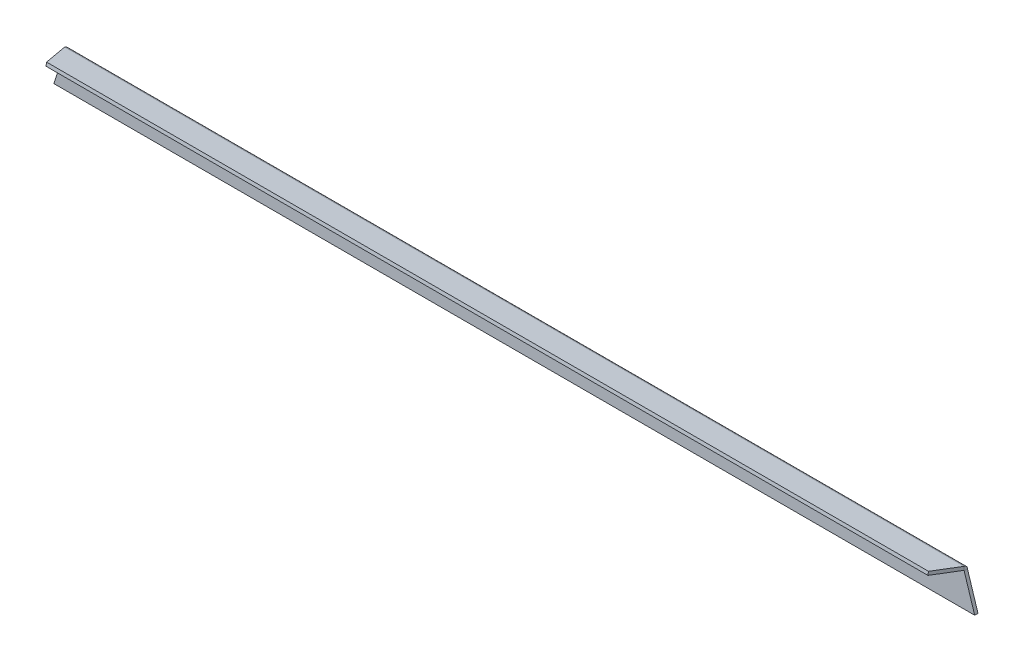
ISO-10303-21;
HEADER;
FILE_DESCRIPTION(('STEP AP214'),'2;1');
FILE_NAME('part.step','',(''),(''),'','','');
FILE_SCHEMA(('AUTOMOTIVE_DESIGN { 1 0 10303 214 1 1 1 1 }'));
ENDSEC;
DATA;
#1=APPLICATION_CONTEXT('core data for automotive mechanical design processes');
#2=APPLICATION_PROTOCOL_DEFINITION('international standard','automotive_design',2000,#1);
#3=PRODUCT_CONTEXT('',#1,'mechanical');
#4=PRODUCT('Part','Part','',(#3));
#5=PRODUCT_RELATED_PRODUCT_CATEGORY('part','',(#4));
#6=PRODUCT_DEFINITION_FORMATION('','',#4);
#7=PRODUCT_DEFINITION_CONTEXT('part definition',#1,'design');
#8=PRODUCT_DEFINITION('design','',#6,#7);
#9=PRODUCT_DEFINITION_SHAPE('','',#8);
#10=(LENGTH_UNIT() NAMED_UNIT(*) SI_UNIT(.MILLI.,.METRE.));
#11=(NAMED_UNIT(*) PLANE_ANGLE_UNIT() SI_UNIT($,.RADIAN.));
#12=(NAMED_UNIT(*) SI_UNIT($,.STERADIAN.) SOLID_ANGLE_UNIT());
#13=UNCERTAINTY_MEASURE_WITH_UNIT(LENGTH_MEASURE(1.E-05),#10,'distance_accuracy_value','');
#14=(GEOMETRIC_REPRESENTATION_CONTEXT(3) GLOBAL_UNCERTAINTY_ASSIGNED_CONTEXT((#13)) GLOBAL_UNIT_ASSIGNED_CONTEXT((#10,
#11,#12)) REPRESENTATION_CONTEXT('',''));
#15=CARTESIAN_POINT('',(0.,0.,0.));
#16=DIRECTION('',(0.,0.,1.));
#17=DIRECTION('',(1.,0.,0.));
#18=AXIS2_PLACEMENT_3D('',#15,#16,#17);
#19=CARTESIAN_POINT('',(-830.,-60.0000000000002,6.));
#20=DIRECTION('',(0.953342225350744,-0.3018917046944,0.));
#21=DIRECTION('',(0.3018917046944,0.953342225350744,0.));
#22=AXIS2_PLACEMENT_3D('',#19,#20,#21);
#23=PLANE('',#22);
#24=DIRECTION('',(-0.3018917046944,-0.953342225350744,0.));
#25=VECTOR('',#24,1.);
#26=CARTESIAN_POINT('',(-830.,-60.0000000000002,0.));
#27=LINE('',#26,#25);
#28=CARTESIAN_POINT('',(-811.,-3.24201747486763E-13,0.));
#29=VERTEX_POINT('',#28);
#30=CARTESIAN_POINT('',(-830.,-60.0000000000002,0.));
#31=VERTEX_POINT('',#30);
#32=EDGE_CURVE('E194',#29,#31,#27,.T.);
#33=ORIENTED_EDGE('',*,*,#32,.T.);
#34=DIRECTION('',(0.,0.,-1.));
#35=VECTOR('',#34,1.);
#36=CARTESIAN_POINT('',(-830.,-60.0000000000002,6.));
#37=LINE('',#36,#35);
#38=CARTESIAN_POINT('',(-830.,-60.0000000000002,6.));
#39=VERTEX_POINT('',#38);
#40=EDGE_CURVE('E13',#39,#31,#37,.T.);
#41=ORIENTED_EDGE('',*,*,#40,.F.);
#42=DIRECTION('',(-0.3018917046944,-0.953342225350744,0.));
#43=VECTOR('',#42,1.);
#44=CARTESIAN_POINT('',(-830.,-60.0000000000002,6.));
#45=LINE('',#44,#43);
#46=CARTESIAN_POINT('',(-811.,0.,6.));
#47=VERTEX_POINT('',#46);
#48=EDGE_CURVE('E209',#47,#39,#45,.T.);
#49=ORIENTED_EDGE('',*,*,#48,.F.);
#50=DIRECTION('',(0.,0.,-1.));
#51=VECTOR('',#50,1.);
#52=CARTESIAN_POINT('',(-811.,0.,6.));
#53=LINE('',#52,#51);
#54=EDGE_CURVE('E215',#47,#29,#53,.T.);
#55=ORIENTED_EDGE('',*,*,#54,.T.);
#56=EDGE_LOOP('',(#33,#41,#49,#55));
#57=FACE_BOUND('',#56,.T.);
#58=ADVANCED_FACE('F51',(#57),#23,.F.);
#59=CARTESIAN_POINT('',(830.,-60.,6.));
#60=DIRECTION('',(0.,1.,0.));
#61=DIRECTION('',(-1.,0.,0.));
#62=AXIS2_PLACEMENT_3D('',#59,#60,#61);
#63=PLANE('',#62);
#64=DIRECTION('',(1.,0.,0.));
#65=VECTOR('',#64,1.);
#66=CARTESIAN_POINT('',(830.,-60.,0.));
#67=LINE('',#66,#65);
#68=CARTESIAN_POINT('',(830.,-60.,0.));
#69=VERTEX_POINT('',#68);
#70=EDGE_CURVE('E202',#31,#69,#67,.T.);
#71=ORIENTED_EDGE('',*,*,#70,.T.);
#72=DIRECTION('',(0.,0.,-1.));
#73=VECTOR('',#72,1.);
#74=CARTESIAN_POINT('',(830.,-60.,6.));
#75=LINE('',#74,#73);
#76=CARTESIAN_POINT('',(830.,-60.,6.));
#77=VERTEX_POINT('',#76);
#78=EDGE_CURVE('E58',#77,#69,#75,.T.);
#79=ORIENTED_EDGE('',*,*,#78,.F.);
#80=DIRECTION('',(1.,0.,0.));
#81=VECTOR('',#80,1.);
#82=CARTESIAN_POINT('',(830.,-60.,6.));
#83=LINE('',#82,#81);
#84=EDGE_CURVE('E211',#39,#77,#83,.T.);
#85=ORIENTED_EDGE('',*,*,#84,.F.);
#86=ORIENTED_EDGE('',*,*,#40,.T.);
#87=EDGE_LOOP('',(#71,#79,#85,#86));
#88=FACE_BOUND('',#87,.T.);
#89=ADVANCED_FACE('F249',(#88),#63,.F.);
#90=CARTESIAN_POINT('',(811.,1.9863115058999E-13,6.));
#91=DIRECTION('',(-0.953342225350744,-0.3018917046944,0.));
#92=DIRECTION('',(0.3018917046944,-0.953342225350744,0.));
#93=AXIS2_PLACEMENT_3D('',#90,#91,#92);
#94=PLANE('',#93);
#95=DIRECTION('',(-0.3018917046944,0.953342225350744,0.));
#96=VECTOR('',#95,1.);
#97=CARTESIAN_POINT('',(811.,1.9863115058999E-13,0.));
#98=LINE('',#97,#96);
#99=CARTESIAN_POINT('',(811.,1.9863115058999E-13,0.));
#100=VERTEX_POINT('',#99);
#101=EDGE_CURVE('E204',#69,#100,#98,.T.);
#102=ORIENTED_EDGE('',*,*,#101,.T.);
#103=DIRECTION('',(0.,0.,-1.));
#104=VECTOR('',#103,1.);
#105=CARTESIAN_POINT('',(811.,1.9863115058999E-13,6.));
#106=LINE('',#105,#104);
#107=CARTESIAN_POINT('',(811.,1.9863115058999E-13,6.));
#108=VERTEX_POINT('',#107);
#109=EDGE_CURVE('E218',#108,#100,#106,.T.);
#110=ORIENTED_EDGE('',*,*,#109,.F.);
#111=DIRECTION('',(-0.3018917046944,0.953342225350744,0.));
#112=VECTOR('',#111,1.);
#113=CARTESIAN_POINT('',(811.,1.9863115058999E-13,6.));
#114=LINE('',#113,#112);
#115=EDGE_CURVE('E70',#77,#108,#114,.T.);
#116=ORIENTED_EDGE('',*,*,#115,.F.);
#117=ORIENTED_EDGE('',*,*,#78,.T.);
#118=EDGE_LOOP('',(#102,#110,#116,#117));
#119=FACE_BOUND('',#118,.T.);
#120=ADVANCED_FACE('F224',(#119),#94,.F.);
#121=CARTESIAN_POINT('',(-811.,0.,6.));
#122=DIRECTION('',(0.,0.,-1.));
#123=DIRECTION('',(-1.,0.,0.));
#124=AXIS2_PLACEMENT_3D('',#121,#122,#123);
#125=PLANE('',#124);
#126=ORIENTED_EDGE('',*,*,#48,.T.);
#127=ORIENTED_EDGE('',*,*,#84,.T.);
#128=ORIENTED_EDGE('',*,*,#115,.T.);
#129=DIRECTION('',(-1.,0.,0.));
#130=VECTOR('',#129,1.);
#131=CARTESIAN_POINT('',(-811.,0.,6.));
#132=LINE('',#131,#130);
#133=EDGE_CURVE('E65',#108,#47,#132,.T.);
#134=ORIENTED_EDGE('',*,*,#133,.T.);
#135=EDGE_LOOP('',(#126,#127,#128,#134));
#136=FACE_BOUND('',#135,.T.);
#137=ADVANCED_FACE('F248',(#136),#125,.F.);
#138=CARTESIAN_POINT('',(-811.,0.,0.));
#139=DIRECTION('',(0.,0.,-1.));
#140=DIRECTION('',(-1.,0.,0.));
#141=AXIS2_PLACEMENT_3D('',#138,#139,#140);
#142=PLANE('',#141);
#143=ORIENTED_EDGE('',*,*,#32,.F.);
#144=DIRECTION('',(-1.,0.,0.));
#145=VECTOR('',#144,1.);
#146=CARTESIAN_POINT('',(-811.,0.,0.));
#147=LINE('',#146,#145);
#148=EDGE_CURVE('E206',#100,#29,#147,.T.);
#149=ORIENTED_EDGE('',*,*,#148,.F.);
#150=ORIENTED_EDGE('',*,*,#101,.F.);
#151=ORIENTED_EDGE('',*,*,#70,.F.);
#152=EDGE_LOOP('',(#143,#149,#150,#151));
#153=FACE_BOUND('',#152,.T.);
#154=ADVANCED_FACE('F228',(#153),#142,.T.);
#155=CARTESIAN_POINT('',(811.,5.23853305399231E-13,-0.0599999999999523));
#156=CARTESIAN_POINT('',(810.983515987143,0.790909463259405,-0.0599999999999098));
#157=CARTESIAN_POINT('',(810.967035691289,1.58144608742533,0.0794086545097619));
#158=CARTESIAN_POINT('',(810.934071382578,3.0677021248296,0.620361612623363));
#159=CARTESIAN_POINT('',(810.917589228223,3.76296675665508,1.02177283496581));
#160=CARTESIAN_POINT('',(810.884624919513,4.97457377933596,2.03843184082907));
#161=CARTESIAN_POINT('',(810.868142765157,5.49061809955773,2.65342951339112));
#162=CARTESIAN_POINT('',(810.835178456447,6.28143841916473,4.02317048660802));
#163=CARTESIAN_POINT('',(810.818698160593,6.55600438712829,4.77748902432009));
#164=CARTESIAN_POINT('',(810.802214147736,6.69334437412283,5.55638279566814));
#165=CARTESIAN_POINT('',(811.,5.20630883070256E-13,0.));
#166=CARTESIAN_POINT('',(810.983515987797,0.783927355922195,0.));
#167=CARTESIAN_POINT('',(810.967035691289,1.56748517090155,0.138177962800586));
#168=CARTESIAN_POINT('',(810.934071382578,3.04062062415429,0.674355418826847));
#169=CARTESIAN_POINT('',(810.917589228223,3.7297474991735,1.07222300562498));
#170=CARTESIAN_POINT('',(810.884624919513,4.93065852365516,2.07990700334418));
#171=CARTESIAN_POINT('',(810.868142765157,5.44214723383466,2.6894755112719));
#172=CARTESIAN_POINT('',(810.835178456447,6.22598623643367,4.04712448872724));
#173=CARTESIAN_POINT('',(810.818698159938,6.49812835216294,4.79478394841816));
#174=CARTESIAN_POINT('',(810.802214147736,6.6342559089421,5.56680168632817));
#175=CARTESIAN_POINT('',(811.,1.98388650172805E-13,6.00000000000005));
#176=CARTESIAN_POINT('',(810.983516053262,0.0857166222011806,6.00000000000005));
#177=CARTESIAN_POINT('',(810.967035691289,0.171393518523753,6.01510879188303));
#178=CARTESIAN_POINT('',(810.934071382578,0.332470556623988,6.07373603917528));
#179=CARTESIAN_POINT('',(810.917589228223,0.407821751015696,6.11724007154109));
#180=CARTESIAN_POINT('',(810.884624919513,0.539132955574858,6.22742325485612));
#181=CARTESIAN_POINT('',(810.868142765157,0.595060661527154,6.29407529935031));
#182=CARTESIAN_POINT('',(810.835178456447,0.68076796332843,6.44252470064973));
#183=CARTESIAN_POINT('',(810.818698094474,0.710524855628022,6.52427635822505));
#184=CARTESIAN_POINT('',(810.802214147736,0.725409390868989,6.60869075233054));
#185=CARTESIAN_POINT('',(811.,1.9513400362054E-13,6.06060000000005));
#186=CARTESIAN_POINT('',(810.983516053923,0.0786646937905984,6.06060000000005));
#187=CARTESIAN_POINT('',(810.967035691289,0.157292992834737,6.07446579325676));
#188=CARTESIAN_POINT('',(810.934071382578,0.305118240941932,6.1282697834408));
#189=CARTESIAN_POINT('',(810.917589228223,0.374270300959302,6.16819474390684));
#190=CARTESIAN_POINT('',(810.884624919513,0.494778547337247,6.26931316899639));
#191=CARTESIAN_POINT('',(810.868142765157,0.546105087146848,6.3304817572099));
#192=CARTESIAN_POINT('',(810.835178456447,0.624761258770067,6.46671824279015));
#193=CARTESIAN_POINT('',(810.818698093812,0.65207006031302,6.5417442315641));
#194=CARTESIAN_POINT('',(810.802214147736,0.66573004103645,6.61921383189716));
#195=B_SPLINE_SURFACE_WITH_KNOTS('',1,3,((#155,#156,#157,#158,#159,#160,#161,#162,#163,#164),
(#165,#166,#167,#168,#169,#170,#171,#172,#173,#174),(#175,#176,#177,#178,#179,#180,#181,#182,
#183,#184),(#185,#186,#187,#188,#189,#190,#191,#192,#193,#194)),.UNSPECIFIED.,.F.,.F.,.F.,(2,1,
1,2),(4,2,2,2,4),(-0.01,0.,1.,1.0101),(0.,0.25,0.5,0.75,1.),.UNSPECIFIED.);
#196=DIRECTION('',(0.,-0.984807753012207,0.173648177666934));
#197=VECTOR('',#196,1.);
#198=CARTESIAN_POINT('',(810.802214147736,6.63425590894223,5.56680168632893));
#199=LINE('',#198,#197);
#200=CARTESIAN_POINT('',(810.802214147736,0.725409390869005,6.60869075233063));
#201=VERTEX_POINT('',#200);
#202=CARTESIAN_POINT('',(810.802214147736,6.63425590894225,5.56680168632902));
#203=VERTEX_POINT('',#202);
#204=EDGE_CURVE('E139',#201,#203,#199,.F.);
#205=CARTESIAN_POINT('',(811.,1.98388650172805E-13,6.00000000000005));
#206=CARTESIAN_POINT('',(810.997939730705,0.0107134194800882,5.99999984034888));
#207=CARTESIAN_POINT('',(810.995879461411,0.0214268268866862,6.0002337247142));
#208=CARTESIAN_POINT('',(810.991758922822,0.0428332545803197,6.0011684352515));
#209=CARTESIAN_POINT('',(810.989698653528,0.0535262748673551,6.00186926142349));
#210=CARTESIAN_POINT('',(810.985578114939,0.0748715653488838,6.00373670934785));
#211=CARTESIAN_POINT('',(810.983517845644,0.0855238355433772,6.00490333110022));
#212=CARTESIAN_POINT('',(810.979397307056,0.106767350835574,6.00770009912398));
#213=CARTESIAN_POINT('',(810.977337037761,0.117358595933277,6.00933024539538));
#214=CARTESIAN_POINT('',(810.973216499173,0.138459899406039,6.01305097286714));
#215=CARTESIAN_POINT('',(810.971156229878,0.148969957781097,6.01514155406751));
#216=CARTESIAN_POINT('',(810.967035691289,0.169888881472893,6.01977916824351));
#217=CARTESIAN_POINT('',(810.964975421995,0.180297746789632,6.02232620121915));
#218=CARTESIAN_POINT('',(810.960854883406,0.200994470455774,6.0278718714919));
#219=CARTESIAN_POINT('',(810.958794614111,0.211282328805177,6.03087050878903));
#220=CARTESIAN_POINT('',(810.954674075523,0.231717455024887,6.03731367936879));
#221=CARTESIAN_POINT('',(810.952613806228,0.241864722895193,6.04075821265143));
#222=CARTESIAN_POINT('',(810.948493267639,0.261999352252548,6.04808661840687));
#223=CARTESIAN_POINT('',(810.946432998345,0.271986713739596,6.05197049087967));
#224=CARTESIAN_POINT('',(810.942312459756,0.291782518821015,6.06017018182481));
#225=CARTESIAN_POINT('',(810.940252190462,0.301590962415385,6.06448600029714));
#226=CARTESIAN_POINT('',(810.936131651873,0.321010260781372,6.07354136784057));
#227=CARTESIAN_POINT('',(810.934071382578,0.330621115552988,6.07828091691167));
#228=CARTESIAN_POINT('',(810.92995084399,0.349626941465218,6.08817472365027));
#229=CARTESIAN_POINT('',(810.927890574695,0.359021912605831,6.09332898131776));
#230=CARTESIAN_POINT('',(810.923770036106,0.377578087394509,6.10404239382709));
#231=CARTESIAN_POINT('',(810.921709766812,0.386739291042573,6.10960154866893));
#232=CARTESIAN_POINT('',(810.917589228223,0.404810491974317,6.12111417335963));
#233=CARTESIAN_POINT('',(810.915528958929,0.413720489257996,6.1270676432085));
#234=CARTESIAN_POINT('',(810.91140842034,0.431272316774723,6.13935756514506));
#235=CARTESIAN_POINT('',(810.909348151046,0.439914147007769,6.14569401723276));
#236=CARTESIAN_POINT('',(810.905227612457,0.456913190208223,6.15873784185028));
#237=CARTESIAN_POINT('',(810.903167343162,0.465270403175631,6.16544521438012));
#238=CARTESIAN_POINT('',(810.899046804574,0.481684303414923,6.17921811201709));
#239=CARTESIAN_POINT('',(810.896986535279,0.489740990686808,6.18628363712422));
#240=CARTESIAN_POINT('',(810.89286599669,0.505538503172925,6.20075939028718));
#241=CARTESIAN_POINT('',(810.890805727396,0.513279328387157,6.208169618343));
#242=CARTESIAN_POINT('',(810.886685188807,0.528430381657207,6.22332067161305));
#243=CARTESIAN_POINT('',(810.884624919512,0.535840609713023,6.23106149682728));
#244=CARTESIAN_POINT('',(810.880504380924,0.550316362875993,6.2468590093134));
#245=CARTESIAN_POINT('',(810.878444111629,0.557381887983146,6.25491569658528));
#246=CARTESIAN_POINT('',(810.87432357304,0.571154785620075,6.27132959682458));
#247=CARTESIAN_POINT('',(810.872263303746,0.577862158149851,6.279686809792));
#248=CARTESIAN_POINT('',(810.868142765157,0.59090598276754,6.29668585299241));
#249=CARTESIAN_POINT('',(810.866082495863,0.597242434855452,6.30532768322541));
#250=CARTESIAN_POINT('',(810.861961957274,0.609532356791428,6.32287951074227));
#251=CARTESIAN_POINT('',(810.85990168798,0.615485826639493,6.33178950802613));
#252=CARTESIAN_POINT('',(810.855781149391,0.626998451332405,6.34986070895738));
#253=CARTESIAN_POINT('',(810.853720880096,0.632557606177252,6.35902191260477));
#254=CARTESIAN_POINT('',(810.849600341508,0.643271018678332,6.37757808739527));
#255=CARTESIAN_POINT('',(810.847540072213,0.648425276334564,6.3869730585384));
#256=CARTESIAN_POINT('',(810.843419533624,0.658319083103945,6.40597888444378));
#257=CARTESIAN_POINT('',(810.84135926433,0.663058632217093,6.41558973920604));
#258=CARTESIAN_POINT('',(810.837238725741,0.672113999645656,6.43500903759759));
#259=CARTESIAN_POINT('',(810.835178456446,0.676429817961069,6.44481748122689));
#260=CARTESIAN_POINT('',(810.831057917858,0.684629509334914,6.46461328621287));
#261=CARTESIAN_POINT('',(810.828997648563,0.688513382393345,6.47460064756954));
#262=CARTESIAN_POINT('',(810.824877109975,0.695841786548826,6.49473527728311));
#263=CARTESIAN_POINT('',(810.82281684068,0.699286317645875,6.50488254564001));
#264=CARTESIAN_POINT('',(810.818696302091,0.705729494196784,6.52531767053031));
#265=CARTESIAN_POINT('',(810.816636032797,0.708728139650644,6.53560552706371));
#266=CARTESIAN_POINT('',(810.812515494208,0.71427378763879,6.55630225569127));
#267=CARTESIAN_POINT('',(810.810455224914,0.716820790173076,6.56671112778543));
#268=CARTESIAN_POINT('',(810.806334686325,0.721458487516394,6.58763003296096));
#269=CARTESIAN_POINT('',(810.80427441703,0.723549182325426,6.59814006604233));
#270=CARTESIAN_POINT('',(810.802214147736,0.725409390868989,6.60869075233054));
#271=B_SPLINE_CURVE_WITH_KNOTS('',3,(#205,#206,#207,#208,#209,#210,#211,#212,#213,#214,#215,
#216,#217,#218,#219,#220,#221,#222,#223,#224,#225,#226,#227,#228,#229,#230,#231,#232,#233,#234,
#235,#236,#237,#238,#239,#240,#241,#242,#243,#244,#245,#246,#247,#248,#249,#250,#251,#252,#253,
#254,#255,#256,#257,#258,#259,#260,#261,#262,#263,#264,#265,#266,#267,#268,#269,#270),
.UNSPECIFIED.,.F.,.F.,(4,2,2,2,2,2,2,2,2,2,2,2,2,2,2,2,2,2,2,2,2,2,2,2,2,2,2,2,2,2,2,2,4),(0.,
0.032726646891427,0.0654532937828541,0.0981799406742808,0.130906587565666,0.163633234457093,
0.19635988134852,0.229086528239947,0.261813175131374,0.294539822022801,0.327266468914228,
0.359993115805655,0.392719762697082,0.425446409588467,0.458173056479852,0.490899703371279,
0.523626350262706,0.556352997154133,0.58907964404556,0.621806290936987,0.654532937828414,
0.687259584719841,0.719986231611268,0.752712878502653,0.78543952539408,0.818166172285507,
0.850892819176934,0.883619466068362,0.916346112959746,0.949072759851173,0.981799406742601,
1.01452605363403,1.04725270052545),.UNSPECIFIED.);
#272=EDGE_CURVE('E156',#108,#201,#271,.T.);
#273=CARTESIAN_POINT('',(811.,5.20630883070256E-13,0.));
#274=CARTESIAN_POINT('',(810.997939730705,0.0979799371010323,-1.46009501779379E-06));
#275=CARTESIAN_POINT('',(810.995879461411,0.195959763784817,0.0021375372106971));
#276=CARTESIAN_POINT('',(810.991758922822,0.391732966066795,0.0106859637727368));
#277=CARTESIAN_POINT('',(810.989698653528,0.489526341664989,0.0170953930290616));
#278=CARTESIAN_POINT('',(810.985578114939,0.68474041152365,0.0341742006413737));
#279=CARTESIAN_POINT('',(810.983517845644,0.782161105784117,0.0448435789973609));
#280=CARTESIAN_POINT('',(810.979397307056,0.976444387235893,0.0704215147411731));
#281=CARTESIAN_POINT('',(810.977337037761,1.0733069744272,0.0853300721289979));
#282=CARTESIAN_POINT('',(810.973216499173,1.26628965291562,0.119358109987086));
#283=CARTESIAN_POINT('',(810.971156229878,1.36240974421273,0.13847759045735));
#284=CARTESIAN_POINT('',(810.967035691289,1.55372446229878,0.18089104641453));
#285=CARTESIAN_POINT('',(810.964975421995,1.64891908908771,0.204185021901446));
#286=CARTESIAN_POINT('',(810.960854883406,1.83820166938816,0.254903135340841));
#287=CARTESIAN_POINT('',(810.958794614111,1.93228962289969,0.282327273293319));
#288=CARTESIAN_POINT('',(810.954674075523,2.1191797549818,0.341253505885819));
#289=CARTESIAN_POINT('',(810.952613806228,2.2119819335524,0.37275560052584));
#290=CARTESIAN_POINT('',(810.948493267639,2.39612386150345,0.43977778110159));
#291=CARTESIAN_POINT('',(810.946432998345,2.48746361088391,0.475297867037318));
#292=CARTESIAN_POINT('',(810.942312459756,2.66850681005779,0.55028841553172));
#293=CARTESIAN_POINT('',(810.940252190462,2.7582102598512,0.589758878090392));
#294=CARTESIAN_POINT('',(810.936131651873,2.9358101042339,0.672575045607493));
#295=CARTESIAN_POINT('',(810.934071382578,3.02370649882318,0.71592075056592));
#296=CARTESIAN_POINT('',(810.92995084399,3.19752491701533,0.806404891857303));
#297=CARTESIAN_POINT('',(810.927890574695,3.2834469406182,0.853543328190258));
#298=CARTESIAN_POINT('',(810.923770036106,3.45315305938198,0.95152320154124));
#299=CARTESIAN_POINT('',(810.921709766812,3.53693715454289,1.00236463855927));
#300=CARTESIAN_POINT('',(810.917589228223,3.70220792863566,1.10765373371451));
#301=CARTESIAN_POINT('',(810.915528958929,3.78369460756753,1.16210139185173));
#302=CARTESIAN_POINT('',(810.91140842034,3.94421543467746,1.27449928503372));
#303=CARTESIAN_POINT('',(810.909348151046,4.02324958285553,1.3324495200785));
#304=CARTESIAN_POINT('',(810.905227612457,4.1787149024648,1.45174225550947));
#305=CARTESIAN_POINT('',(810.903167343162,4.255146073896,1.51308475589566));
#306=CARTESIAN_POINT('',(810.899046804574,4.40525994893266,1.6390452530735));
#307=CARTESIAN_POINT('',(810.896986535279,4.47894265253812,1.70366324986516));
#308=CARTESIAN_POINT('',(810.89286599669,4.62341933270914,1.83605173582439));
#309=CARTESIAN_POINT('',(810.890805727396,4.6942133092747,1.90382222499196));
#310=CARTESIAN_POINT('',(810.886685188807,4.8327777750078,2.04238669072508));
#311=CARTESIAN_POINT('',(810.884624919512,4.90054826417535,2.11318066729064));
#312=CARTESIAN_POINT('',(810.880504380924,5.0329367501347,2.25765734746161));
#313=CARTESIAN_POINT('',(810.878444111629,5.0975547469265,2.33134005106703));
#314=CARTESIAN_POINT('',(810.87432357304,5.22351524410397,2.48145392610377));
#315=CARTESIAN_POINT('',(810.872263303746,5.28485774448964,2.55788509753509));
#316=CARTESIAN_POINT('',(810.868142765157,5.40415047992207,2.71335041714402));
#317=CARTESIAN_POINT('',(810.866082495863,5.46210071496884,2.79238456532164));
#318=CARTESIAN_POINT('',(810.861961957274,5.57449860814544,2.95290539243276));
#319=CARTESIAN_POINT('',(810.85990168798,5.62894626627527,3.03439207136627));
#320=CARTESIAN_POINT('',(810.855781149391,5.73423536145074,3.19966284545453));
#321=CARTESIAN_POINT('',(810.853720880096,5.78507679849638,3.28344694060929));
#322=CARTESIAN_POINT('',(810.849600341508,5.88305667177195,3.45315305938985));
#323=CARTESIAN_POINT('',(810.847540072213,5.93019510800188,3.53907508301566));
#324=CARTESIAN_POINT('',(810.843419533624,6.02067924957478,3.71289350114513));
#325=CARTESIAN_POINT('',(810.84135926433,6.06402495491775,3.80078989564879));
#326=CARTESIAN_POINT('',(810.837238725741,6.1468411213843,3.97838974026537));
#327=CARTESIAN_POINT('',(810.835178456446,6.18631158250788,4.06809319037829));
#328=CARTESIAN_POINT('',(810.831057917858,6.26130213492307,4.24913638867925));
#329=CARTESIAN_POINT('',(810.828997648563,6.29682222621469,4.34047613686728));
#330=CARTESIAN_POINT('',(810.824877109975,6.36384439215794,4.5246180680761));
#331=CARTESIAN_POINT('',(810.82281684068,6.39534646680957,4.61742025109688));
#332=CARTESIAN_POINT('',(810.818696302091,6.45427275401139,4.80431037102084));
#333=CARTESIAN_POINT('',(810.816636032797,6.48169696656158,4.89839830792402));
#334=CARTESIAN_POINT('',(810.812515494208,6.5324148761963,5.08768093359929));
#335=CARTESIAN_POINT('',(810.810455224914,6.55570857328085,5.18287562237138));
#336=CARTESIAN_POINT('',(810.806334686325,6.5981227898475,5.37419017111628));
#337=CARTESIAN_POINT('',(810.80427441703,6.61724330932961,5.47031003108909));
#338=CARTESIAN_POINT('',(810.802214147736,6.6342559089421,5.56680168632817));
#339=B_SPLINE_CURVE_WITH_KNOTS('',3,(#273,#274,#275,#276,#277,#278,#279,#280,#281,#282,#283,
#284,#285,#286,#287,#288,#289,#290,#291,#292,#293,#294,#295,#296,#297,#298,#299,#300,#301,#302,
#303,#304,#305,#306,#307,#308,#309,#310,#311,#312,#313,#314,#315,#316,#317,#318,#319,#320,#321,
#322,#323,#324,#325,#326,#327,#328,#329,#330,#331,#332,#333,#334,#335,#336,#337,#338),
.UNSPECIFIED.,.F.,.F.,(4,2,2,2,2,2,2,2,2,2,2,2,2,2,2,2,2,2,2,2,2,2,2,2,2,2,2,2,2,2,2,2,4),(0.,
0.293981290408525,0.58796258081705,0.881943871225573,1.17592516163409,1.46990645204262,
1.76388774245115,2.05786903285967,2.35185032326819,2.64583161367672,2.93981290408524,
3.23379419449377,3.52777548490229,3.82175677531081,4.11573806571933,4.40971935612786,
4.70370064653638,4.99768193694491,5.29166322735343,5.58564451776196,5.87962580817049,
6.17360709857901,6.46758838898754,6.76156967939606,7.05555096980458,7.34953226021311,
7.64351355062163,7.93749484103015,8.23147613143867,8.5254574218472,8.81943871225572,
9.11342000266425,9.40740129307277),.UNSPECIFIED.);
#340=EDGE_CURVE('E163',#100,#203,#339,.T.);
#341=ORIENTED_EDGE('',*,*,#204,.F.);
#342=ORIENTED_EDGE('',*,*,#272,.F.);
#343=ORIENTED_EDGE('',*,*,#109,.T.);
#344=ORIENTED_EDGE('',*,*,#340,.T.);
#345=EDGE_LOOP('',(#341,#342,#343,#344));
#346=FACE_BOUND('',#345,.T.);
#347=ADVANCED_FACE('F234',(#346),#195,.F.);
#348=CARTESIAN_POINT('',(-810.802214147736,6.69334437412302,5.55638279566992));
#349=CARTESIAN_POINT('',(-810.818698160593,6.55600438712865,4.77748902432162));
#350=CARTESIAN_POINT('',(-810.835178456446,6.28143841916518,4.02317048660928));
#351=CARTESIAN_POINT('',(-810.868142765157,5.49061809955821,2.65342951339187));
#352=CARTESIAN_POINT('',(-810.884624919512,4.97457377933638,2.03843184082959));
#353=CARTESIAN_POINT('',(-810.917589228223,3.76296675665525,1.02177283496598));
#354=CARTESIAN_POINT('',(-810.934071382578,3.06770212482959,0.62036161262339));
#355=CARTESIAN_POINT('',(-810.967035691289,1.58144608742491,0.0794086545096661));
#356=CARTESIAN_POINT('',(-810.983515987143,0.790909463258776,-0.059999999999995));
#357=CARTESIAN_POINT('',(-811.,-3.27440823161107E-13,-0.0599999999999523));
#358=CARTESIAN_POINT('',(-810.802214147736,6.63425590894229,5.56680168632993));
#359=CARTESIAN_POINT('',(-810.818698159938,6.4981283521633,4.79478394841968));
#360=CARTESIAN_POINT('',(-810.835178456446,6.22598623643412,4.04712448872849));
#361=CARTESIAN_POINT('',(-810.868142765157,5.44214723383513,2.68947551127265));
#362=CARTESIAN_POINT('',(-810.884624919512,4.93065852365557,2.07990700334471));
#363=CARTESIAN_POINT('',(-810.917589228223,3.72974749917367,1.07222300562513));
#364=CARTESIAN_POINT('',(-810.934071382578,3.04062062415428,0.674355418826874));
#365=CARTESIAN_POINT('',(-810.967035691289,1.56748517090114,0.138177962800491));
#366=CARTESIAN_POINT('',(-810.983515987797,0.783927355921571,0.));
#367=CARTESIAN_POINT('',(-811.,-3.24201747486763E-13,0.));
#368=CARTESIAN_POINT('',(-810.802214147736,0.725409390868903,6.60869075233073));
#369=CARTESIAN_POINT('',(-810.818698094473,0.710524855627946,6.52427635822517));
#370=CARTESIAN_POINT('',(-810.835178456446,0.680767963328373,6.44252470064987));
#371=CARTESIAN_POINT('',(-810.868142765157,0.595060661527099,6.29407529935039));
#372=CARTESIAN_POINT('',(-810.884624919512,0.539132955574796,6.22742325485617));
#373=CARTESIAN_POINT('',(-810.917589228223,0.407821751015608,6.11724007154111));
#374=CARTESIAN_POINT('',(-810.934071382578,0.33247055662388,6.07373603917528));
#375=CARTESIAN_POINT('',(-810.967035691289,0.171393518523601,6.01510879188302));
#376=CARTESIAN_POINT('',(-810.983516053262,0.0857166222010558,6.00000000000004));
#377=CARTESIAN_POINT('',(-811.,0.,6.00000000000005));
#378=CARTESIAN_POINT('',(-810.802214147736,0.665730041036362,6.61921383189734));
#379=CARTESIAN_POINT('',(-810.818698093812,0.652070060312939,6.5417442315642));
#380=CARTESIAN_POINT('',(-810.835178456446,0.624761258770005,6.46671824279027));
#381=CARTESIAN_POINT('',(-810.868142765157,0.546105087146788,6.33048175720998));
#382=CARTESIAN_POINT('',(-810.884624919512,0.49477854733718,6.26931316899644));
#383=CARTESIAN_POINT('',(-810.917589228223,0.374270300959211,6.16819474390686));
#384=CARTESIAN_POINT('',(-810.934071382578,0.305118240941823,6.1282697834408));
#385=CARTESIAN_POINT('',(-810.967035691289,0.157292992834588,6.07446579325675));
#386=CARTESIAN_POINT('',(-810.983516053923,0.0786646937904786,6.06060000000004));
#387=CARTESIAN_POINT('',(-811.,0.,6.06060000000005));
#388=B_SPLINE_SURFACE_WITH_KNOTS('',1,3,((#348,#349,#350,#351,#352,#353,#354,#355,#356,#357),
(#358,#359,#360,#361,#362,#363,#364,#365,#366,#367),(#368,#369,#370,#371,#372,#373,#374,#375,
#376,#377),(#378,#379,#380,#381,#382,#383,#384,#385,#386,#387)),.UNSPECIFIED.,.F.,.F.,.F.,(2,1,
1,2),(4,2,2,2,4),(-0.01,0.,1.,1.0101),(0.,0.25,0.5,0.75,1.),.UNSPECIFIED.);
#389=CARTESIAN_POINT('',(-810.802214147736,0.725409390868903,6.60869075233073));
#390=CARTESIAN_POINT('',(-810.80427441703,0.723549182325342,6.59814006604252));
#391=CARTESIAN_POINT('',(-810.806334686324,0.721458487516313,6.58763003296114));
#392=CARTESIAN_POINT('',(-810.810455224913,0.716820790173,6.56671112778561));
#393=CARTESIAN_POINT('',(-810.812515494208,0.714273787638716,6.55630225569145));
#394=CARTESIAN_POINT('',(-810.816636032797,0.708728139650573,6.53560552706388));
#395=CARTESIAN_POINT('',(-810.818696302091,0.705729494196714,6.52531767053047));
#396=CARTESIAN_POINT('',(-810.82281684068,0.699286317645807,6.50488254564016));
#397=CARTESIAN_POINT('',(-810.824877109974,0.695841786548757,6.49473527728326));
#398=CARTESIAN_POINT('',(-810.828997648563,0.688513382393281,6.47460064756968));
#399=CARTESIAN_POINT('',(-810.831057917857,0.684629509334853,6.46461328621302));
#400=CARTESIAN_POINT('',(-810.835178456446,0.676429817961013,6.44481748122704));
#401=CARTESIAN_POINT('',(-810.837238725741,0.672113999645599,6.43500903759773));
#402=CARTESIAN_POINT('',(-810.84135926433,0.663058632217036,6.41558973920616));
#403=CARTESIAN_POINT('',(-810.843419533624,0.658319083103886,6.4059788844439));
#404=CARTESIAN_POINT('',(-810.847540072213,0.648425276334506,6.38697305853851));
#405=CARTESIAN_POINT('',(-810.849600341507,0.643271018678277,6.37757808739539));
#406=CARTESIAN_POINT('',(-810.853720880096,0.632557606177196,6.35902191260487));
#407=CARTESIAN_POINT('',(-810.855781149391,0.626998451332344,6.34986070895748));
#408=CARTESIAN_POINT('',(-810.859901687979,0.615485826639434,6.33178950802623));
#409=CARTESIAN_POINT('',(-810.861961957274,0.609532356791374,6.32287951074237));
#410=CARTESIAN_POINT('',(-810.866082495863,0.5972424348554,6.3053276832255));
#411=CARTESIAN_POINT('',(-810.868142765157,0.590905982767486,6.2966858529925));
#412=CARTESIAN_POINT('',(-810.872263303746,0.577862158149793,6.27968680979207));
#413=CARTESIAN_POINT('',(-810.87432357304,0.571154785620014,6.27132959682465));
#414=CARTESIAN_POINT('',(-810.878444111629,0.557381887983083,6.25491569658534));
#415=CARTESIAN_POINT('',(-810.880504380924,0.550316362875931,6.24685900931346));
#416=CARTESIAN_POINT('',(-810.884624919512,0.53584060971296,6.23106149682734));
#417=CARTESIAN_POINT('',(-810.886685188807,0.528430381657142,6.22332067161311));
#418=CARTESIAN_POINT('',(-810.890805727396,0.513279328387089,6.20816961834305));
#419=CARTESIAN_POINT('',(-810.89286599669,0.505538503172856,6.20075939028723));
#420=CARTESIAN_POINT('',(-810.896986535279,0.489740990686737,6.18628363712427));
#421=CARTESIAN_POINT('',(-810.899046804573,0.481684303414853,6.17921811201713));
#422=CARTESIAN_POINT('',(-810.903167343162,0.465270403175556,6.16544521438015));
#423=CARTESIAN_POINT('',(-810.905227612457,0.456913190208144,6.15873784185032));
#424=CARTESIAN_POINT('',(-810.909348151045,0.439914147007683,6.14569401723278));
#425=CARTESIAN_POINT('',(-810.91140842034,0.431272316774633,6.13935756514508));
#426=CARTESIAN_POINT('',(-810.915528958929,0.413720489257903,6.12706764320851));
#427=CARTESIAN_POINT('',(-810.917589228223,0.404810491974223,6.12111417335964));
#428=CARTESIAN_POINT('',(-810.921709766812,0.386739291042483,6.10960154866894));
#429=CARTESIAN_POINT('',(-810.923770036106,0.377578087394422,6.10404239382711));
#430=CARTESIAN_POINT('',(-810.927890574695,0.359021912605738,6.09332898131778));
#431=CARTESIAN_POINT('',(-810.92995084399,0.349626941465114,6.08817472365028));
#432=CARTESIAN_POINT('',(-810.934071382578,0.330621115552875,6.07828091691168));
#433=CARTESIAN_POINT('',(-810.936131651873,0.321010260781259,6.07354136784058));
#434=CARTESIAN_POINT('',(-810.940252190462,0.30159096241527,6.06448600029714));
#435=CARTESIAN_POINT('',(-810.942312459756,0.291782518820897,6.06017018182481));
#436=CARTESIAN_POINT('',(-810.946432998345,0.271986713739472,6.05197049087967));
#437=CARTESIAN_POINT('',(-810.948493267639,0.26199935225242,6.04808661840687));
#438=CARTESIAN_POINT('',(-810.952613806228,0.241864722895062,6.04075821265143));
#439=CARTESIAN_POINT('',(-810.954674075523,0.231717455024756,6.03731367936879));
#440=CARTESIAN_POINT('',(-810.958794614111,0.211282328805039,6.03087050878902));
#441=CARTESIAN_POINT('',(-810.960854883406,0.200994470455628,6.0278718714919));
#442=CARTESIAN_POINT('',(-810.964975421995,0.18029774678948,6.02232620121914));
#443=CARTESIAN_POINT('',(-810.967035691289,0.169888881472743,6.0197791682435));
#444=CARTESIAN_POINT('',(-810.971156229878,0.148969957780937,6.0151415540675));
#445=CARTESIAN_POINT('',(-810.973216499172,0.138459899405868,6.01305097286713));
#446=CARTESIAN_POINT('',(-810.977337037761,0.117358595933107,6.00933024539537));
#447=CARTESIAN_POINT('',(-810.979397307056,0.106767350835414,6.00770009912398));
#448=CARTESIAN_POINT('',(-810.983517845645,0.0855238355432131,6.00490333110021));
#449=CARTESIAN_POINT('',(-810.985578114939,0.0748715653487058,6.00373670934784));
#450=CARTESIAN_POINT('',(-810.989698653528,0.0535262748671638,6.00186926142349));
#451=CARTESIAN_POINT('',(-810.991758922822,0.042833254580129,6.0011684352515));
#452=CARTESIAN_POINT('',(-810.995879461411,0.0214268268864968,6.0002337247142));
#453=CARTESIAN_POINT('',(-810.997939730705,0.0107134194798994,5.99999984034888));
#454=CARTESIAN_POINT('',(-811.,0.,6.00000000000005));
#455=B_SPLINE_CURVE_WITH_KNOTS('',3,(#389,#390,#391,#392,#393,#394,#395,#396,#397,#398,#399,
#400,#401,#402,#403,#404,#405,#406,#407,#408,#409,#410,#411,#412,#413,#414,#415,#416,#417,#418,
#419,#420,#421,#422,#423,#424,#425,#426,#427,#428,#429,#430,#431,#432,#433,#434,#435,#436,#437,
#438,#439,#440,#441,#442,#443,#444,#445,#446,#447,#448,#449,#450,#451,#452,#453,#454),
.UNSPECIFIED.,.F.,.F.,(4,2,2,2,2,2,2,2,2,2,2,2,2,2,2,2,2,2,2,2,2,2,2,2,2,2,2,2,2,2,2,2,4),(0.,
0.0327266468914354,0.065453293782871,0.0981799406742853,0.130906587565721,0.163633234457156,
0.196359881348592,0.229086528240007,0.261813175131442,0.294539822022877,0.327266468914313,
0.359993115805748,0.392719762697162,0.425446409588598,0.458173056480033,0.490899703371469,
0.523626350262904,0.556352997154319,0.589079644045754,0.62180629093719,0.654532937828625,
0.687259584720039,0.719986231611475,0.75271287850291,0.785439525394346,0.818166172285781,
0.850892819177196,0.883619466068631,0.916346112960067,0.949072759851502,0.981799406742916,
1.01452605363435,1.04725270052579),.UNSPECIFIED.);
#456=CARTESIAN_POINT('',(-810.802214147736,0.725409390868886,6.60869075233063));
#457=VERTEX_POINT('',#456);
#458=EDGE_CURVE('E162',#457,#47,#455,.T.);
#459=DIRECTION('',(0.,-0.984807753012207,0.173648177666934));
#460=VECTOR('',#459,1.);
#461=CARTESIAN_POINT('',(-810.802214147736,0.725409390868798,6.60869075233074));
#462=LINE('',#461,#460);
#463=CARTESIAN_POINT('',(-810.802214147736,6.63425590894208,5.56680168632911));
#464=VERTEX_POINT('',#463);
#465=EDGE_CURVE('E150',#457,#464,#462,.F.);
#466=CARTESIAN_POINT('',(-810.802214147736,6.63425590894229,5.56680168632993));
#467=CARTESIAN_POINT('',(-810.80427441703,6.61724330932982,5.47031003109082));
#468=CARTESIAN_POINT('',(-810.806334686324,6.59812278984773,5.37419017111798));
#469=CARTESIAN_POINT('',(-810.810455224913,6.55570857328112,5.18287562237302));
#470=CARTESIAN_POINT('',(-810.812515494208,6.53241487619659,5.0876809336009));
#471=CARTESIAN_POINT('',(-810.816636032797,6.48169696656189,4.89839830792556));
#472=CARTESIAN_POINT('',(-810.818696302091,6.45427275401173,4.80431037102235));
#473=CARTESIAN_POINT('',(-810.82281684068,6.39534646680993,4.61742025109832));
#474=CARTESIAN_POINT('',(-810.824877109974,6.36384439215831,4.52461806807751));
#475=CARTESIAN_POINT('',(-810.828997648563,6.29682222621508,4.34047613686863));
#476=CARTESIAN_POINT('',(-810.831057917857,6.26130213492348,4.24913638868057));
#477=CARTESIAN_POINT('',(-810.835178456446,6.1863115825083,4.06809319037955));
#478=CARTESIAN_POINT('',(-810.837238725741,6.14684112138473,3.9783897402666));
#479=CARTESIAN_POINT('',(-810.84135926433,6.06402495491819,3.80078989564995));
#480=CARTESIAN_POINT('',(-810.843419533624,6.02067924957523,3.71289350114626));
#481=CARTESIAN_POINT('',(-810.847540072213,5.93019510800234,3.53907508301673));
#482=CARTESIAN_POINT('',(-810.849600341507,5.88305667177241,3.45315305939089));
#483=CARTESIAN_POINT('',(-810.853720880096,5.78507679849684,3.28344694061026));
#484=CARTESIAN_POINT('',(-810.855781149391,5.7342353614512,3.19966284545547));
#485=CARTESIAN_POINT('',(-810.859901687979,5.62894626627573,3.03439207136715));
#486=CARTESIAN_POINT('',(-810.861961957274,5.57449860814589,2.95290539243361));
#487=CARTESIAN_POINT('',(-810.866082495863,5.46210071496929,2.79238456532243));
#488=CARTESIAN_POINT('',(-810.868142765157,5.40415047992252,2.71335041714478));
#489=CARTESIAN_POINT('',(-810.872263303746,5.28485774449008,2.55788509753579));
#490=CARTESIAN_POINT('',(-810.87432357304,5.2235152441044,2.48145392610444));
#491=CARTESIAN_POINT('',(-810.878444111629,5.09755474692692,2.33134005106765));
#492=CARTESIAN_POINT('',(-810.880504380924,5.0329367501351,2.2576573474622));
#493=CARTESIAN_POINT('',(-810.884624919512,4.90054826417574,2.11318066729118));
#494=CARTESIAN_POINT('',(-810.886685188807,4.83277777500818,2.0423866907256));
#495=CARTESIAN_POINT('',(-810.890805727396,4.69421330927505,1.90382222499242));
#496=CARTESIAN_POINT('',(-810.89286599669,4.62341933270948,1.83605173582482));
#497=CARTESIAN_POINT('',(-810.896986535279,4.47894265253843,1.70366324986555));
#498=CARTESIAN_POINT('',(-810.899046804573,4.40525994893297,1.63904525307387));
#499=CARTESIAN_POINT('',(-810.903167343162,4.25514607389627,1.51308475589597));
#500=CARTESIAN_POINT('',(-810.905227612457,4.17871490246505,1.45174225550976));
#501=CARTESIAN_POINT('',(-810.909348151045,4.02324958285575,1.33244952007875));
#502=CARTESIAN_POINT('',(-810.91140842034,3.94421543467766,1.27449928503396));
#503=CARTESIAN_POINT('',(-810.915528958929,3.7836946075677,1.16210139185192));
#504=CARTESIAN_POINT('',(-810.917589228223,3.70220792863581,1.10765373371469));
#505=CARTESIAN_POINT('',(-810.921709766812,3.536937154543,1.00236463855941));
#506=CARTESIAN_POINT('',(-810.923770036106,3.45315305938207,0.951523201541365));
#507=CARTESIAN_POINT('',(-810.927890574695,3.28344694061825,0.853543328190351));
#508=CARTESIAN_POINT('',(-810.92995084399,3.19752491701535,0.806404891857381));
#509=CARTESIAN_POINT('',(-810.934071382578,3.02370649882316,0.715920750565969));
#510=CARTESIAN_POINT('',(-810.936131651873,2.93581010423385,0.672575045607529));
#511=CARTESIAN_POINT('',(-810.940252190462,2.75821025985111,0.589758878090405));
#512=CARTESIAN_POINT('',(-810.942312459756,2.66850681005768,0.550288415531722));
#513=CARTESIAN_POINT('',(-810.946432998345,2.48746361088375,0.475297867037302));
#514=CARTESIAN_POINT('',(-810.948493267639,2.39612386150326,0.439777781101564));
#515=CARTESIAN_POINT('',(-810.952613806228,2.21198193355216,0.3727556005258));
#516=CARTESIAN_POINT('',(-810.954674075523,2.11917975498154,0.341253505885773));
#517=CARTESIAN_POINT('',(-810.958794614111,1.93228962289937,0.282327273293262));
#518=CARTESIAN_POINT('',(-810.960854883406,1.83820166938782,0.254903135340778));
#519=CARTESIAN_POINT('',(-810.964975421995,1.64891908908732,0.204185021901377));
#520=CARTESIAN_POINT('',(-810.967035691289,1.55372446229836,0.180891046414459));
#521=CARTESIAN_POINT('',(-810.971156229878,1.36240974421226,0.138477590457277));
#522=CARTESIAN_POINT('',(-810.973216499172,1.26628965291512,0.119358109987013));
#523=CARTESIAN_POINT('',(-810.977337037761,1.07330697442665,0.085330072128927));
#524=CARTESIAN_POINT('',(-810.979397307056,0.976444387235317,0.0704215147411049));
#525=CARTESIAN_POINT('',(-810.983517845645,0.782161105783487,0.0448435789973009));
#526=CARTESIAN_POINT('',(-810.985578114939,0.684740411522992,0.034174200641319));
#527=CARTESIAN_POINT('',(-810.989698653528,0.489526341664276,0.0170953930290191));
#528=CARTESIAN_POINT('',(-810.991758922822,0.391732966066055,0.0106859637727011));
#529=CARTESIAN_POINT('',(-810.995879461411,0.195959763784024,0.00213753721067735));
#530=CARTESIAN_POINT('',(-810.997939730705,0.0979799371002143,-1.46009502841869E-06));
#531=CARTESIAN_POINT('',(-811.,-3.24201747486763E-13,0.));
#532=B_SPLINE_CURVE_WITH_KNOTS('',3,(#466,#467,#468,#469,#470,#471,#472,#473,#474,#475,#476,
#477,#478,#479,#480,#481,#482,#483,#484,#485,#486,#487,#488,#489,#490,#491,#492,#493,#494,#495,
#496,#497,#498,#499,#500,#501,#502,#503,#504,#505,#506,#507,#508,#509,#510,#511,#512,#513,#514,
#515,#516,#517,#518,#519,#520,#521,#522,#523,#524,#525,#526,#527,#528,#529,#530,#531),
.UNSPECIFIED.,.F.,.F.,(4,2,2,2,2,2,2,2,2,2,2,2,2,2,2,2,2,2,2,2,2,2,2,2,2,2,2,2,2,2,2,2,4),(0.,
0.293981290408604,0.587962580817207,0.881943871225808,1.17592516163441,1.46990645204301,
1.76388774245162,2.05786903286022,2.35185032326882,2.64583161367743,2.93981290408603,
3.23379419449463,3.52777548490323,3.82175677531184,4.11573806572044,4.40971935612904,
4.70370064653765,4.99768193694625,5.29166322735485,5.58564451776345,5.87962580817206,
6.17360709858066,6.46758838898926,6.76156967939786,7.05555096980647,7.34953226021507,
7.64351355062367,7.93749484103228,8.23147613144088,8.52545742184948,8.81943871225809,
9.11342000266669,9.40740129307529),.UNSPECIFIED.);
#533=EDGE_CURVE('E161',#464,#29,#532,.T.);
#534=ORIENTED_EDGE('',*,*,#458,.F.);
#535=ORIENTED_EDGE('',*,*,#465,.T.);
#536=ORIENTED_EDGE('',*,*,#533,.T.);
#537=ORIENTED_EDGE('',*,*,#54,.F.);
#538=EDGE_LOOP('',(#534,#535,#536,#537));
#539=FACE_BOUND('',#538,.T.);
#540=ADVANCED_FACE('F178',(#539),#388,.F.);
#541=CARTESIAN_POINT('',(-811.,0.,6.7366000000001));
#542=DIRECTION('',(-1.,0.,0.));
#543=DIRECTION('',(0.,0.984807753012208,-0.173648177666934));
#544=AXIS2_PLACEMENT_3D('',#541,#542,#543);
#545=CYLINDRICAL_SURFACE('',#544,6.73660000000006);
#546=ORIENTED_EDGE('',*,*,#148,.T.);
#547=ORIENTED_EDGE('',*,*,#533,.F.);
#548=DIRECTION('',(-1.,0.,0.));
#549=VECTOR('',#548,1.);
#550=CARTESIAN_POINT('',(810.802214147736,6.63425590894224,5.56680168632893));
#551=LINE('',#550,#549);
#552=EDGE_CURVE('E148',#464,#203,#551,.F.);
#553=ORIENTED_EDGE('',*,*,#552,.T.);
#554=ORIENTED_EDGE('',*,*,#340,.F.);
#555=EDGE_LOOP('',(#546,#547,#553,#554));
#556=FACE_BOUND('',#555,.T.);
#557=ADVANCED_FACE('F176',(#556),#545,.T.);
#558=CARTESIAN_POINT('',(-811.,0.,6.7366000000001));
#559=DIRECTION('',(-1.,0.,0.));
#560=DIRECTION('',(0.,0.984807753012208,-0.173648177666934));
#561=AXIS2_PLACEMENT_3D('',#558,#559,#560);
#562=CYLINDRICAL_SURFACE('',#561,0.736600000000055);
#563=ORIENTED_EDGE('',*,*,#133,.F.);
#564=ORIENTED_EDGE('',*,*,#272,.T.);
#565=DIRECTION('',(-1.,0.,0.));
#566=VECTOR('',#565,1.);
#567=CARTESIAN_POINT('',(810.802214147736,0.72540939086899,6.60869075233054));
#568=LINE('',#567,#566);
#569=EDGE_CURVE('E153',#201,#457,#568,.T.);
#570=ORIENTED_EDGE('',*,*,#569,.T.);
#571=ORIENTED_EDGE('',*,*,#458,.T.);
#572=EDGE_LOOP('',(#563,#564,#570,#571));
#573=FACE_BOUND('',#572,.T.);
#574=ADVANCED_FACE('F167',(#573),#562,.F.);
#575=CARTESIAN_POINT('',(811.,6.52692730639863,4.9581109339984));
#576=DIRECTION('',(-0.952424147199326,-0.052923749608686,-0.300145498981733));
#577=DIRECTION('',(-0.300566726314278,0.,0.953760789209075));
#578=AXIS2_PLACEMENT_3D('',#575,#576,#577);
#579=PLANE('',#578);
#580=ORIENTED_EDGE('',*,*,#204,.T.);
#581=DIRECTION('',(0.304775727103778,-0.165386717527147,-0.937954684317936));
#582=VECTOR('',#581,1.);
#583=CARTESIAN_POINT('',(795.,15.2093361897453,54.1984985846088));
#584=LINE('',#583,#582);
#585=CARTESIAN_POINT('',(795.,15.2093361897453,54.1984985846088));
#586=VERTEX_POINT('',#585);
#587=EDGE_CURVE('E120',#586,#203,#584,.T.);
#588=ORIENTED_EDGE('',*,*,#587,.F.);
#589=DIRECTION('',(0.,-0.984807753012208,0.173648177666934));
#590=VECTOR('',#589,1.);
#591=CARTESIAN_POINT('',(795.,15.2093361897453,54.1984985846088));
#592=LINE('',#591,#590);
#593=CARTESIAN_POINT('',(795.,9.30048967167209,55.2403876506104));
#594=VERTEX_POINT('',#593);
#595=EDGE_CURVE('E126',#586,#594,#592,.T.);
#596=ORIENTED_EDGE('',*,*,#595,.T.);
#597=DIRECTION('',(-0.304775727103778,0.165386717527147,0.937954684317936));
#598=VECTOR('',#597,1.);
#599=CARTESIAN_POINT('',(811.,0.618080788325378,6.));
#600=LINE('',#599,#598);
#601=EDGE_CURVE('E146',#594,#201,#600,.F.);
#602=ORIENTED_EDGE('',*,*,#601,.T.);
#603=EDGE_LOOP('',(#580,#588,#596,#602));
#604=FACE_BOUND('',#603,.T.);
#605=ADVANCED_FACE('F138',(#604),#579,.F.);
#606=CARTESIAN_POINT('',(-795.,15.2093361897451,54.1984985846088));
#607=DIRECTION('',(0.952424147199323,-0.0529237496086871,-0.300145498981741));
#608=DIRECTION('',(-0.300566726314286,0.,-0.953760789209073));
#609=AXIS2_PLACEMENT_3D('',#606,#607,#608);
#610=PLANE('',#609);
#611=ORIENTED_EDGE('',*,*,#465,.F.);
#612=DIRECTION('',(-0.304775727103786,-0.165386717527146,-0.937954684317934));
#613=VECTOR('',#612,1.);
#614=CARTESIAN_POINT('',(-795.,9.30048967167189,55.2403876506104));
#615=LINE('',#614,#613);
#616=CARTESIAN_POINT('',(-795.,9.30048967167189,55.2403876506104));
#617=VERTEX_POINT('',#616);
#618=EDGE_CURVE('E142',#457,#617,#615,.F.);
#619=ORIENTED_EDGE('',*,*,#618,.T.);
#620=DIRECTION('',(0.,-0.984807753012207,0.173648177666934));
#621=VECTOR('',#620,1.);
#622=CARTESIAN_POINT('',(-795.,15.2093361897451,54.1984985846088));
#623=LINE('',#622,#621);
#624=CARTESIAN_POINT('',(-795.,15.2093361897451,54.1984985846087));
#625=VERTEX_POINT('',#624);
#626=EDGE_CURVE('E135',#625,#617,#623,.T.);
#627=ORIENTED_EDGE('',*,*,#626,.F.);
#628=DIRECTION('',(0.304775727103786,0.165386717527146,0.937954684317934));
#629=VECTOR('',#628,1.);
#630=CARTESIAN_POINT('',(-647.30769230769,95.3546489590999,508.725153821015));
#631=LINE('',#630,#629);
#632=EDGE_CURVE('E122',#464,#625,#631,.T.);
#633=ORIENTED_EDGE('',*,*,#632,.F.);
#634=EDGE_LOOP('',(#611,#619,#627,#633));
#635=FACE_BOUND('',#634,.T.);
#636=ADVANCED_FACE('F237',(#635),#610,.F.);
#637=CARTESIAN_POINT('',(795.,15.2093361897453,54.1984985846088));
#638=DIRECTION('',(0.,-0.984807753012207,0.173648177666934));
#639=DIRECTION('',(0.,-0.173648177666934,-0.984807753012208));
#640=AXIS2_PLACEMENT_3D('',#637,#638,#639);
#641=PLANE('',#640);
#642=ORIENTED_EDGE('',*,*,#552,.F.);
#643=ORIENTED_EDGE('',*,*,#632,.T.);
#644=DIRECTION('',(1.,0.,0.));
#645=VECTOR('',#644,1.);
#646=CARTESIAN_POINT('',(795.,15.2093361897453,54.1984985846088));
#647=LINE('',#646,#645);
#648=EDGE_CURVE('E115',#625,#586,#647,.T.);
#649=ORIENTED_EDGE('',*,*,#648,.T.);
#650=ORIENTED_EDGE('',*,*,#587,.T.);
#651=EDGE_LOOP('',(#642,#643,#649,#650));
#652=FACE_BOUND('',#651,.T.);
#653=ADVANCED_FACE('F118',(#652),#641,.F.);
#654=CARTESIAN_POINT('',(795.,9.30048967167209,55.2403876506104));
#655=DIRECTION('',(0.,-0.984807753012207,0.173648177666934));
#656=DIRECTION('',(0.,-0.173648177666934,-0.984807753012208));
#657=AXIS2_PLACEMENT_3D('',#654,#655,#656);
#658=PLANE('',#657);
#659=ORIENTED_EDGE('',*,*,#618,.F.);
#660=ORIENTED_EDGE('',*,*,#569,.F.);
#661=ORIENTED_EDGE('',*,*,#601,.F.);
#662=DIRECTION('',(-1.,0.,0.));
#663=VECTOR('',#662,1.);
#664=CARTESIAN_POINT('',(795.,9.30048967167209,55.2403876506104));
#665=LINE('',#664,#663);
#666=EDGE_CURVE('E131',#617,#594,#665,.F.);
#667=ORIENTED_EDGE('',*,*,#666,.F.);
#668=EDGE_LOOP('',(#659,#660,#661,#667));
#669=FACE_BOUND('',#668,.T.);
#670=ADVANCED_FACE('F241',(#669),#658,.T.);
#671=CARTESIAN_POINT('',(795.,15.2093361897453,54.1984985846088));
#672=DIRECTION('',(0.,-0.173648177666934,-0.984807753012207));
#673=DIRECTION('',(0.,0.984807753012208,-0.173648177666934));
#674=AXIS2_PLACEMENT_3D('',#671,#672,#673);
#675=PLANE('',#674);
#676=ORIENTED_EDGE('',*,*,#666,.T.);
#677=ORIENTED_EDGE('',*,*,#595,.F.);
#678=ORIENTED_EDGE('',*,*,#648,.F.);
#679=ORIENTED_EDGE('',*,*,#626,.T.);
#680=EDGE_LOOP('',(#676,#677,#678,#679));
#681=FACE_BOUND('',#680,.T.);
#682=ADVANCED_FACE('F129',(#681),#675,.F.);
#683=CLOSED_SHELL('',(#58,#89,#120,#137,#154,#347,#540,#557,#574,#605,#636,#653,#670,#682));
#684=MANIFOLD_SOLID_BREP('B2',#683);
#685=ADVANCED_BREP_SHAPE_REPRESENTATION('',(#18,#684),#14);
#686=SHAPE_DEFINITION_REPRESENTATION(#9,#685);
ENDSEC;
END-ISO-10303-21;
